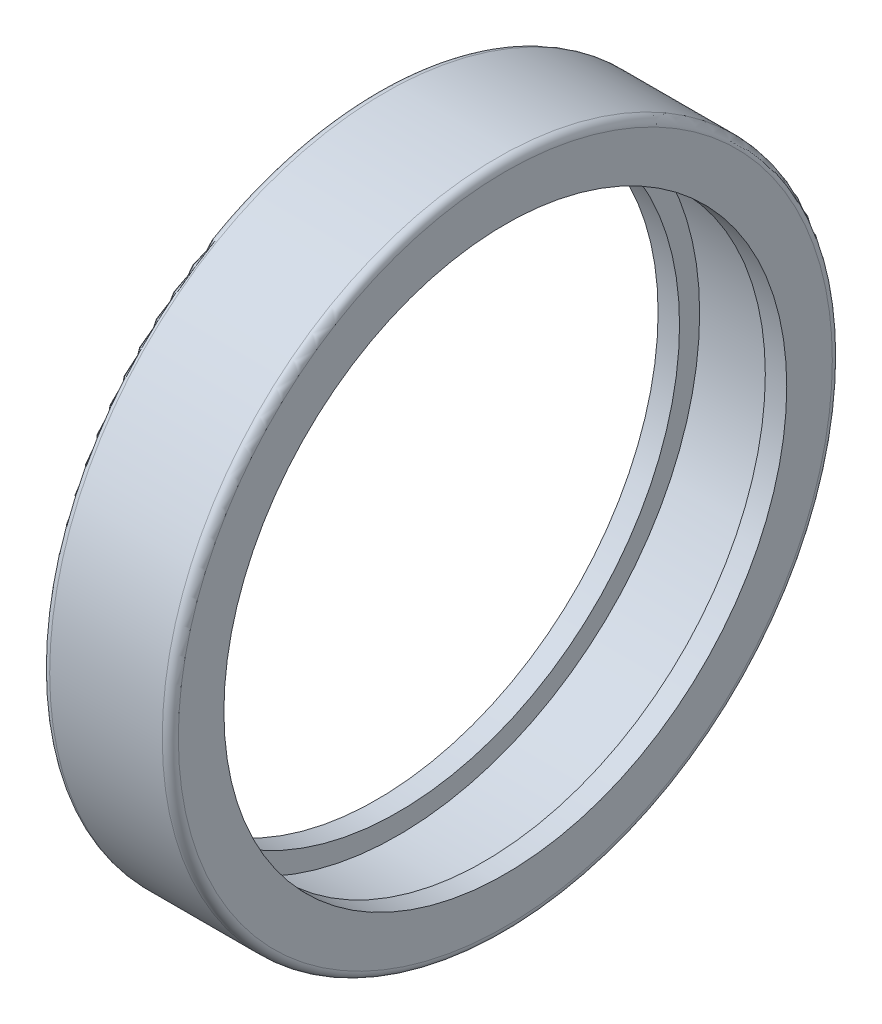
ISO-10303-21;
HEADER;
FILE_DESCRIPTION(('STEP AP214'),'2;1');
FILE_NAME('part.step','',(''),(''),'','','');
FILE_SCHEMA(('AUTOMOTIVE_DESIGN { 1 0 10303 214 1 1 1 1 }'));
ENDSEC;
DATA;
#1=APPLICATION_CONTEXT('core data for automotive mechanical design processes');
#2=APPLICATION_PROTOCOL_DEFINITION('international standard','automotive_design',2000,#1);
#3=PRODUCT_CONTEXT('',#1,'mechanical');
#4=PRODUCT('Part','Part','',(#3));
#5=PRODUCT_RELATED_PRODUCT_CATEGORY('part','',(#4));
#6=PRODUCT_DEFINITION_FORMATION('','',#4);
#7=PRODUCT_DEFINITION_CONTEXT('part definition',#1,'design');
#8=PRODUCT_DEFINITION('design','',#6,#7);
#9=PRODUCT_DEFINITION_SHAPE('','',#8);
#10=(LENGTH_UNIT() NAMED_UNIT(*) SI_UNIT(.MILLI.,.METRE.));
#11=(NAMED_UNIT(*) PLANE_ANGLE_UNIT() SI_UNIT($,.RADIAN.));
#12=(NAMED_UNIT(*) SI_UNIT($,.STERADIAN.) SOLID_ANGLE_UNIT());
#13=UNCERTAINTY_MEASURE_WITH_UNIT(LENGTH_MEASURE(1.E-05),#10,'distance_accuracy_value','');
#14=(GEOMETRIC_REPRESENTATION_CONTEXT(3) GLOBAL_UNCERTAINTY_ASSIGNED_CONTEXT((#13)) GLOBAL_UNIT_ASSIGNED_CONTEXT((#10,
#11,#12)) REPRESENTATION_CONTEXT('',''));
#15=CARTESIAN_POINT('',(0.,0.,0.));
#16=DIRECTION('',(0.,0.,1.));
#17=DIRECTION('',(1.,0.,0.));
#18=AXIS2_PLACEMENT_3D('',#15,#16,#17);
#19=CARTESIAN_POINT('',(12.,0.,0.));
#20=DIRECTION('',(1.,0.,0.));
#21=DIRECTION('',(0.,0.,-1.));
#22=AXIS2_PLACEMENT_3D('',#19,#20,#21);
#23=CYLINDRICAL_SURFACE('',#22,56.25);
#24=CARTESIAN_POINT('',(4.,0.,0.));
#25=DIRECTION('',(1.,0.,0.));
#26=DIRECTION('',(0.,0.,-1.));
#27=AXIS2_PLACEMENT_3D('',#24,#25,#26);
#28=CIRCLE('',#27,56.25);
#29=CARTESIAN_POINT('',(4.,0.,-56.25));
#30=VERTEX_POINT('',#29);
#31=EDGE_CURVE('E207',#30,#30,#28,.T.);
#32=ORIENTED_EDGE('',*,*,#31,.F.);
#33=EDGE_LOOP('',(#32));
#34=FACE_BOUND('',#33,.T.);
#35=CARTESIAN_POINT('',(20.,0.,0.));
#36=DIRECTION('',(1.,0.,0.));
#37=DIRECTION('',(0.,0.,-1.));
#38=AXIS2_PLACEMENT_3D('',#35,#36,#37);
#39=CIRCLE('',#38,56.25);
#40=CARTESIAN_POINT('',(20.,0.,-56.25));
#41=VERTEX_POINT('',#40);
#42=EDGE_CURVE('E210',#41,#41,#39,.F.);
#43=ORIENTED_EDGE('',*,*,#42,.F.);
#44=EDGE_LOOP('',(#43));
#45=FACE_BOUND('',#44,.T.);
#46=ADVANCED_FACE('F16',(#34,#45),#23,.F.);
#47=CARTESIAN_POINT('',(4.,54.375,0.));
#48=DIRECTION('',(1.,0.,0.));
#49=DIRECTION('',(0.,0.,-1.));
#50=AXIS2_PLACEMENT_3D('',#47,#48,#49);
#51=PLANE('',#50);
#52=CARTESIAN_POINT('',(4.,0.,0.));
#53=DIRECTION('',(1.,0.,0.));
#54=DIRECTION('',(0.,0.,-1.));
#55=AXIS2_PLACEMENT_3D('',#52,#53,#54);
#56=CIRCLE('',#55,52.5);
#57=CARTESIAN_POINT('',(4.,0.,-52.5));
#58=VERTEX_POINT('',#57);
#59=EDGE_CURVE('E212',#58,#58,#56,.F.);
#60=ORIENTED_EDGE('',*,*,#59,.T.);
#61=EDGE_LOOP('',(#60));
#62=FACE_BOUND('',#61,.T.);
#63=ORIENTED_EDGE('',*,*,#31,.T.);
#64=EDGE_LOOP('',(#63));
#65=FACE_BOUND('',#64,.T.);
#66=ADVANCED_FACE('F152',(#62,#65),#51,.T.);
#67=CARTESIAN_POINT('',(20.,54.375,0.));
#68=DIRECTION('',(-1.,0.,0.));
#69=DIRECTION('',(0.,0.,1.));
#70=AXIS2_PLACEMENT_3D('',#67,#68,#69);
#71=PLANE('',#70);
#72=CARTESIAN_POINT('',(20.,0.,0.));
#73=DIRECTION('',(1.,0.,0.));
#74=DIRECTION('',(0.,0.,-1.));
#75=AXIS2_PLACEMENT_3D('',#72,#73,#74);
#76=CIRCLE('',#75,52.5);
#77=CARTESIAN_POINT('',(20.,0.,-52.5));
#78=VERTEX_POINT('',#77);
#79=EDGE_CURVE('E215',#78,#78,#76,.T.);
#80=ORIENTED_EDGE('',*,*,#79,.T.);
#81=EDGE_LOOP('',(#80));
#82=FACE_BOUND('',#81,.T.);
#83=ORIENTED_EDGE('',*,*,#42,.T.);
#84=EDGE_LOOP('',(#83));
#85=FACE_BOUND('',#84,.T.);
#86=ADVANCED_FACE('F147',(#82,#85),#71,.T.);
#87=CARTESIAN_POINT('',(2.,0.,0.));
#88=DIRECTION('',(1.,0.,0.));
#89=DIRECTION('',(0.,0.,-1.));
#90=AXIS2_PLACEMENT_3D('',#87,#88,#89);
#91=CYLINDRICAL_SURFACE('',#90,52.5);
#92=CARTESIAN_POINT('',(0.,0.,0.));
#93=DIRECTION('',(1.,0.,0.));
#94=DIRECTION('',(0.,0.,-1.));
#95=AXIS2_PLACEMENT_3D('',#92,#93,#94);
#96=CIRCLE('',#95,52.5);
#97=CARTESIAN_POINT('',(0.,0.,-52.5));
#98=VERTEX_POINT('',#97);
#99=EDGE_CURVE('E237',#98,#98,#96,.T.);
#100=ORIENTED_EDGE('',*,*,#99,.F.);
#101=EDGE_LOOP('',(#100));
#102=FACE_BOUND('',#101,.T.);
#103=ORIENTED_EDGE('',*,*,#59,.F.);
#104=EDGE_LOOP('',(#103));
#105=FACE_BOUND('',#104,.T.);
#106=ADVANCED_FACE('F142',(#102,#105),#91,.F.);
#107=CARTESIAN_POINT('',(22.,0.,0.));
#108=DIRECTION('',(1.,0.,0.));
#109=DIRECTION('',(0.,0.,-1.));
#110=AXIS2_PLACEMENT_3D('',#107,#108,#109);
#111=CYLINDRICAL_SURFACE('',#110,52.5);
#112=ORIENTED_EDGE('',*,*,#79,.F.);
#113=EDGE_LOOP('',(#112));
#114=FACE_BOUND('',#113,.T.);
#115=CARTESIAN_POINT('',(24.,0.,0.));
#116=DIRECTION('',(1.,0.,0.));
#117=DIRECTION('',(0.,0.,-1.));
#118=AXIS2_PLACEMENT_3D('',#115,#116,#117);
#119=CIRCLE('',#118,52.5);
#120=CARTESIAN_POINT('',(24.,0.,-52.5));
#121=VERTEX_POINT('',#120);
#122=EDGE_CURVE('E63',#121,#121,#119,.F.);
#123=ORIENTED_EDGE('',*,*,#122,.F.);
#124=EDGE_LOOP('',(#123));
#125=FACE_BOUND('',#124,.T.);
#126=ADVANCED_FACE('F138',(#114,#125),#111,.F.);
#127=CARTESIAN_POINT('',(0.,56.75,0.));
#128=DIRECTION('',(-1.,0.,0.));
#129=DIRECTION('',(0.,0.,1.));
#130=AXIS2_PLACEMENT_3D('',#127,#128,#129);
#131=PLANE('',#130);
#132=ORIENTED_EDGE('',*,*,#99,.T.);
#133=EDGE_LOOP('',(#132));
#134=FACE_BOUND('',#133,.T.);
#135=CARTESIAN_POINT('',(0.,0.,0.));
#136=DIRECTION('',(1.,0.,0.));
#137=DIRECTION('',(0.,0.,-1.));
#138=AXIS2_PLACEMENT_3D('',#135,#136,#137);
#139=CIRCLE('',#138,61.);
#140=CARTESIAN_POINT('',(0.,0.,-61.));
#141=VERTEX_POINT('',#140);
#142=CARTESIAN_POINT('',(0.,61.,0.));
#143=VERTEX_POINT('',#142);
#144=EDGE_CURVE('E55',#141,#143,#139,.T.);
#145=ORIENTED_EDGE('',*,*,#144,.F.);
#146=CARTESIAN_POINT('',(0.,0.,0.));
#147=DIRECTION('',(1.,0.,0.));
#148=DIRECTION('',(0.,0.,1.));
#149=AXIS2_PLACEMENT_3D('',#146,#147,#148);
#150=CIRCLE('',#149,61.);
#151=CARTESIAN_POINT('',(0.,0.,61.));
#152=VERTEX_POINT('',#151);
#153=EDGE_CURVE('E59',#152,#141,#150,.T.);
#154=ORIENTED_EDGE('',*,*,#153,.F.);
#155=CARTESIAN_POINT('',(0.,0.,0.));
#156=DIRECTION('',(1.,0.,0.));
#157=DIRECTION('',(0.,1.,0.));
#158=AXIS2_PLACEMENT_3D('',#155,#156,#157);
#159=CIRCLE('',#158,61.);
#160=EDGE_CURVE('E52',#143,#152,#159,.T.);
#161=ORIENTED_EDGE('',*,*,#160,.F.);
#162=EDGE_LOOP('',(#145,#154,#161));
#163=FACE_BOUND('',#162,.T.);
#164=ADVANCED_FACE('F58',(#134,#163),#131,.T.);
#165=CARTESIAN_POINT('',(24.,56.75,0.));
#166=DIRECTION('',(1.,0.,0.));
#167=DIRECTION('',(0.,0.,-1.));
#168=AXIS2_PLACEMENT_3D('',#165,#166,#167);
#169=PLANE('',#168);
#170=ORIENTED_EDGE('',*,*,#122,.T.);
#171=EDGE_LOOP('',(#170));
#172=FACE_BOUND('',#171,.T.);
#173=CARTESIAN_POINT('',(24.,0.,0.));
#174=DIRECTION('',(-1.,0.,0.));
#175=DIRECTION('',(0.,0.,-1.));
#176=AXIS2_PLACEMENT_3D('',#173,#174,#175);
#177=CIRCLE('',#176,61.);
#178=CARTESIAN_POINT('',(24.,0.,-61.));
#179=VERTEX_POINT('',#178);
#180=CARTESIAN_POINT('',(24.,0.,61.));
#181=VERTEX_POINT('',#180);
#182=EDGE_CURVE('E68',#179,#181,#177,.T.);
#183=ORIENTED_EDGE('',*,*,#182,.F.);
#184=CARTESIAN_POINT('',(24.,0.,0.));
#185=DIRECTION('',(-1.,0.,0.));
#186=DIRECTION('',(0.,1.,0.));
#187=AXIS2_PLACEMENT_3D('',#184,#185,#186);
#188=CIRCLE('',#187,61.);
#189=CARTESIAN_POINT('',(24.,61.,0.));
#190=VERTEX_POINT('',#189);
#191=EDGE_CURVE('E37',#190,#179,#188,.T.);
#192=ORIENTED_EDGE('',*,*,#191,.F.);
#193=CARTESIAN_POINT('',(24.,0.,0.));
#194=DIRECTION('',(-1.,0.,0.));
#195=DIRECTION('',(0.,0.,1.));
#196=AXIS2_PLACEMENT_3D('',#193,#194,#195);
#197=CIRCLE('',#196,61.);
#198=EDGE_CURVE('E109',#181,#190,#197,.T.);
#199=ORIENTED_EDGE('',*,*,#198,.F.);
#200=EDGE_LOOP('',(#183,#192,#199));
#201=FACE_BOUND('',#200,.T.);
#202=ADVANCED_FACE('F85',(#172,#201),#169,.T.);
#203=CARTESIAN_POINT('',(1.5,0.,0.));
#204=DIRECTION('',(1.,0.,0.));
#205=DIRECTION('',(0.,0.,-1.));
#206=AXIS2_PLACEMENT_3D('',#203,#204,#205);
#207=TOROIDAL_SURFACE('',#206,61.,1.5);
#208=CARTESIAN_POINT('',(1.5,0.,0.));
#209=DIRECTION('',(1.,0.,0.));
#210=DIRECTION('',(0.,0.,-1.));
#211=AXIS2_PLACEMENT_3D('',#208,#209,#210);
#212=CIRCLE('',#211,62.5);
#213=CARTESIAN_POINT('',(1.5,0.,-62.5));
#214=VERTEX_POINT('',#213);
#215=EDGE_CURVE('E28',#214,#214,#212,.T.);
#216=ORIENTED_EDGE('',*,*,#215,.F.);
#217=EDGE_LOOP('',(#216));
#218=FACE_BOUND('',#217,.T.);
#219=ORIENTED_EDGE('',*,*,#153,.T.);
#220=ORIENTED_EDGE('',*,*,#144,.T.);
#221=ORIENTED_EDGE('',*,*,#160,.T.);
#222=EDGE_LOOP('',(#219,#220,#221));
#223=FACE_BOUND('',#222,.T.);
#224=ADVANCED_FACE('F67',(#218,#223),#207,.T.);
#225=CARTESIAN_POINT('',(22.5,0.,0.));
#226=DIRECTION('',(1.,0.,0.));
#227=DIRECTION('',(0.,0.,-1.));
#228=AXIS2_PLACEMENT_3D('',#225,#226,#227);
#229=TOROIDAL_SURFACE('',#228,61.,1.5);
#230=CARTESIAN_POINT('',(22.5,0.,0.));
#231=DIRECTION('',(1.,0.,0.));
#232=DIRECTION('',(0.,0.,-1.));
#233=AXIS2_PLACEMENT_3D('',#230,#231,#232);
#234=CIRCLE('',#233,62.5);
#235=CARTESIAN_POINT('',(22.5,0.,-62.5));
#236=VERTEX_POINT('',#235);
#237=EDGE_CURVE('E10',#236,#236,#234,.F.);
#238=ORIENTED_EDGE('',*,*,#237,.F.);
#239=EDGE_LOOP('',(#238));
#240=FACE_BOUND('',#239,.T.);
#241=ORIENTED_EDGE('',*,*,#198,.T.);
#242=ORIENTED_EDGE('',*,*,#191,.T.);
#243=ORIENTED_EDGE('',*,*,#182,.T.);
#244=EDGE_LOOP('',(#241,#242,#243));
#245=FACE_BOUND('',#244,.T.);
#246=ADVANCED_FACE('F84',(#240,#245),#229,.T.);
#247=CARTESIAN_POINT('',(12.,0.,0.));
#248=DIRECTION('',(1.,0.,0.));
#249=DIRECTION('',(0.,0.,-1.));
#250=AXIS2_PLACEMENT_3D('',#247,#248,#249);
#251=CYLINDRICAL_SURFACE('',#250,62.5);
#252=ORIENTED_EDGE('',*,*,#215,.T.);
#253=EDGE_LOOP('',(#252));
#254=FACE_BOUND('',#253,.T.);
#255=ORIENTED_EDGE('',*,*,#237,.T.);
#256=EDGE_LOOP('',(#255));
#257=FACE_BOUND('',#256,.T.);
#258=ADVANCED_FACE('F18',(#254,#257),#251,.T.);
#259=CLOSED_SHELL('',(#46,#66,#86,#106,#126,#164,#202,#224,#246,#258));
#260=MANIFOLD_SOLID_BREP('B1',#259);
#261=ADVANCED_BREP_SHAPE_REPRESENTATION('',(#18,#260),#14);
#262=SHAPE_DEFINITION_REPRESENTATION(#9,#261);
ENDSEC;
END-ISO-10303-21;
